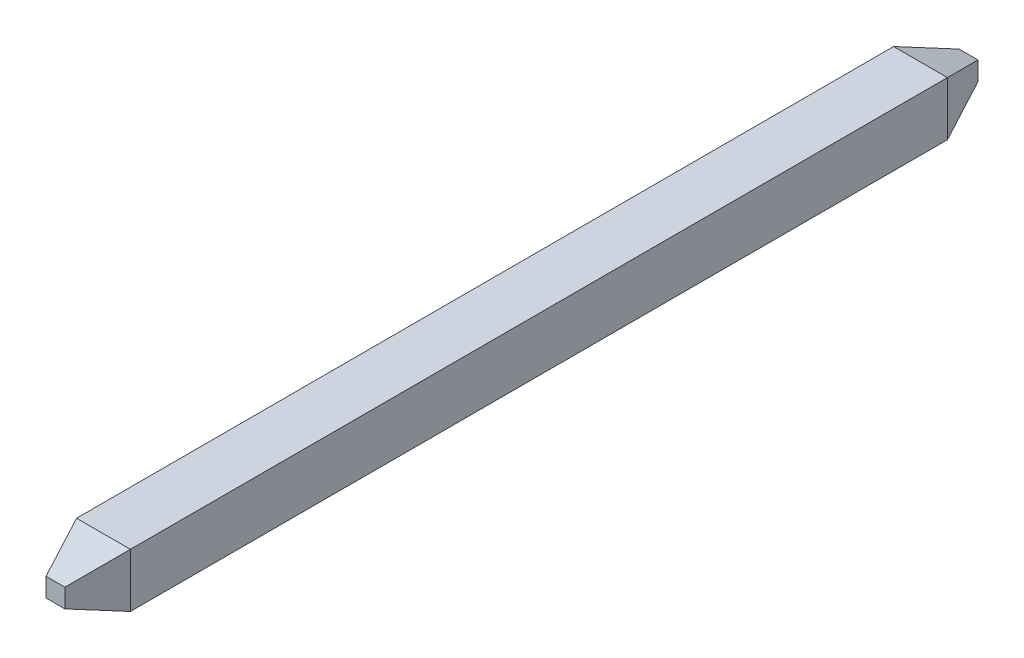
ISO-10303-21;
HEADER;
FILE_DESCRIPTION(('STEP AP214'),'2;1');
FILE_NAME('part.step','',(''),(''),'','','');
FILE_SCHEMA(('AUTOMOTIVE_DESIGN { 1 0 10303 214 1 1 1 1 }'));
ENDSEC;
DATA;
#1=APPLICATION_CONTEXT('core data for automotive mechanical design processes');
#2=APPLICATION_PROTOCOL_DEFINITION('international standard','automotive_design',2000,#1);
#3=PRODUCT_CONTEXT('',#1,'mechanical');
#4=PRODUCT('Part','Part','',(#3));
#5=PRODUCT_RELATED_PRODUCT_CATEGORY('part','',(#4));
#6=PRODUCT_DEFINITION_FORMATION('','',#4);
#7=PRODUCT_DEFINITION_CONTEXT('part definition',#1,'design');
#8=PRODUCT_DEFINITION('design','',#6,#7);
#9=PRODUCT_DEFINITION_SHAPE('','',#8);
#10=(LENGTH_UNIT() NAMED_UNIT(*) SI_UNIT(.MILLI.,.METRE.));
#11=(NAMED_UNIT(*) PLANE_ANGLE_UNIT() SI_UNIT($,.RADIAN.));
#12=(NAMED_UNIT(*) SI_UNIT($,.STERADIAN.) SOLID_ANGLE_UNIT());
#13=UNCERTAINTY_MEASURE_WITH_UNIT(LENGTH_MEASURE(1.E-05),#10,'distance_accuracy_value','');
#14=(GEOMETRIC_REPRESENTATION_CONTEXT(3) GLOBAL_UNCERTAINTY_ASSIGNED_CONTEXT((#13)) GLOBAL_UNIT_ASSIGNED_CONTEXT((#10,
#11,#12)) REPRESENTATION_CONTEXT('',''));
#15=CARTESIAN_POINT('',(0.,0.,0.));
#16=DIRECTION('',(0.,0.,1.));
#17=DIRECTION('',(1.,0.,0.));
#18=AXIS2_PLACEMENT_3D('',#15,#16,#17);
#19=CARTESIAN_POINT('',(-0.559999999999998,-0.560000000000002,17.));
#20=DIRECTION('',(0.,1.,0.));
#21=DIRECTION('',(-1.,0.,0.));
#22=AXIS2_PLACEMENT_3D('',#19,#20,#21);
#23=PLANE('',#22);
#24=DIRECTION('',(1.,0.,0.));
#25=VECTOR('',#24,1.);
#26=CARTESIAN_POINT('',(-0.559999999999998,-0.560000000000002,0.));
#27=LINE('',#26,#25);
#28=CARTESIAN_POINT('',(-0.559999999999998,-0.560000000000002,0.));
#29=VERTEX_POINT('',#28);
#30=CARTESIAN_POINT('',(0.559999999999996,-0.560000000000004,0.));
#31=VERTEX_POINT('',#30);
#32=EDGE_CURVE('E109',#29,#31,#27,.T.);
#33=ORIENTED_EDGE('',*,*,#32,.T.);
#34=DIRECTION('',(0.,0.,-1.));
#35=VECTOR('',#34,1.);
#36=CARTESIAN_POINT('',(0.560000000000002,-0.559999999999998,17.));
#37=LINE('',#36,#35);
#38=CARTESIAN_POINT('',(0.560000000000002,-0.559999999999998,17.));
#39=VERTEX_POINT('',#38);
#40=EDGE_CURVE('E11',#39,#31,#37,.T.);
#41=ORIENTED_EDGE('',*,*,#40,.F.);
#42=DIRECTION('',(1.,0.,0.));
#43=VECTOR('',#42,1.);
#44=CARTESIAN_POINT('',(-0.559999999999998,-0.560000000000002,17.));
#45=LINE('',#44,#43);
#46=CARTESIAN_POINT('',(-0.560000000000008,-0.560000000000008,17.));
#47=VERTEX_POINT('',#46);
#48=EDGE_CURVE('E124',#47,#39,#45,.T.);
#49=ORIENTED_EDGE('',*,*,#48,.F.);
#50=DIRECTION('',(0.,0.,-1.));
#51=VECTOR('',#50,1.);
#52=CARTESIAN_POINT('',(-0.559999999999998,-0.560000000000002,17.));
#53=LINE('',#52,#51);
#54=EDGE_CURVE('E122',#47,#29,#53,.T.);
#55=ORIENTED_EDGE('',*,*,#54,.T.);
#56=EDGE_LOOP('',(#33,#41,#49,#55));
#57=FACE_BOUND('',#56,.T.);
#58=ADVANCED_FACE('F33',(#57),#23,.F.);
#59=CARTESIAN_POINT('',(0.560000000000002,-0.559999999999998,17.));
#60=DIRECTION('',(-1.,0.,0.));
#61=DIRECTION('',(0.,-1.,0.));
#62=AXIS2_PLACEMENT_3D('',#59,#60,#61);
#63=PLANE('',#62);
#64=DIRECTION('',(0.,1.,0.));
#65=VECTOR('',#64,1.);
#66=CARTESIAN_POINT('',(0.560000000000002,-0.559999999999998,0.));
#67=LINE('',#66,#65);
#68=CARTESIAN_POINT('',(0.559999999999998,0.560000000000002,0.));
#69=VERTEX_POINT('',#68);
#70=EDGE_CURVE('E116',#31,#69,#67,.T.);
#71=ORIENTED_EDGE('',*,*,#70,.T.);
#72=DIRECTION('',(0.,0.,-1.));
#73=VECTOR('',#72,1.);
#74=CARTESIAN_POINT('',(0.559999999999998,0.560000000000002,17.));
#75=LINE('',#74,#73);
#76=CARTESIAN_POINT('',(0.559999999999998,0.560000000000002,17.));
#77=VERTEX_POINT('',#76);
#78=EDGE_CURVE('E41',#77,#69,#75,.T.);
#79=ORIENTED_EDGE('',*,*,#78,.F.);
#80=DIRECTION('',(0.,1.,0.));
#81=VECTOR('',#80,1.);
#82=CARTESIAN_POINT('',(0.560000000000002,-0.559999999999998,17.));
#83=LINE('',#82,#81);
#84=EDGE_CURVE('E144',#39,#77,#83,.T.);
#85=ORIENTED_EDGE('',*,*,#84,.F.);
#86=ORIENTED_EDGE('',*,*,#40,.T.);
#87=EDGE_LOOP('',(#71,#79,#85,#86));
#88=FACE_BOUND('',#87,.T.);
#89=ADVANCED_FACE('F142',(#88),#63,.F.);
#90=CARTESIAN_POINT('',(0.559999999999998,0.560000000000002,17.));
#91=DIRECTION('',(0.,-1.,0.));
#92=DIRECTION('',(1.,0.,0.));
#93=AXIS2_PLACEMENT_3D('',#90,#91,#92);
#94=PLANE('',#93);
#95=DIRECTION('',(-1.,0.,0.));
#96=VECTOR('',#95,1.);
#97=CARTESIAN_POINT('',(0.559999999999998,0.560000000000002,0.));
#98=LINE('',#97,#96);
#99=CARTESIAN_POINT('',(-0.56,0.56,0.));
#100=VERTEX_POINT('',#99);
#101=EDGE_CURVE('E125',#69,#100,#98,.T.);
#102=ORIENTED_EDGE('',*,*,#101,.T.);
#103=DIRECTION('',(0.,0.,-1.));
#104=VECTOR('',#103,1.);
#105=CARTESIAN_POINT('',(-0.560000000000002,0.559999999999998,17.));
#106=LINE('',#105,#104);
#107=CARTESIAN_POINT('',(-0.560000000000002,0.559999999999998,17.));
#108=VERTEX_POINT('',#107);
#109=EDGE_CURVE('E48',#108,#100,#106,.T.);
#110=ORIENTED_EDGE('',*,*,#109,.F.);
#111=DIRECTION('',(-1.,0.,0.));
#112=VECTOR('',#111,1.);
#113=CARTESIAN_POINT('',(0.559999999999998,0.560000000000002,17.));
#114=LINE('',#113,#112);
#115=EDGE_CURVE('E131',#77,#108,#114,.T.);
#116=ORIENTED_EDGE('',*,*,#115,.F.);
#117=ORIENTED_EDGE('',*,*,#78,.T.);
#118=EDGE_LOOP('',(#102,#110,#116,#117));
#119=FACE_BOUND('',#118,.T.);
#120=ADVANCED_FACE('F135',(#119),#94,.F.);
#121=CARTESIAN_POINT('',(-0.560000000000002,0.559999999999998,17.));
#122=DIRECTION('',(1.,0.,0.));
#123=DIRECTION('',(0.,1.,0.));
#124=AXIS2_PLACEMENT_3D('',#121,#122,#123);
#125=PLANE('',#124);
#126=DIRECTION('',(0.,-1.,0.));
#127=VECTOR('',#126,1.);
#128=CARTESIAN_POINT('',(-0.560000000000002,0.559999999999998,0.));
#129=LINE('',#128,#127);
#130=EDGE_CURVE('E98',#100,#29,#129,.T.);
#131=ORIENTED_EDGE('',*,*,#130,.T.);
#132=ORIENTED_EDGE('',*,*,#54,.F.);
#133=DIRECTION('',(0.,-1.,0.));
#134=VECTOR('',#133,1.);
#135=CARTESIAN_POINT('',(-0.560000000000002,0.559999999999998,17.));
#136=LINE('',#135,#134);
#137=EDGE_CURVE('E128',#108,#47,#136,.T.);
#138=ORIENTED_EDGE('',*,*,#137,.F.);
#139=ORIENTED_EDGE('',*,*,#109,.T.);
#140=EDGE_LOOP('',(#131,#132,#138,#139));
#141=FACE_BOUND('',#140,.T.);
#142=ADVANCED_FACE('F121',(#141),#125,.F.);
#143=CARTESIAN_POINT('',(0.560000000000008,-0.560000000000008,17.));
#144=DIRECTION('',(0.939692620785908,0.,0.342020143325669));
#145=DIRECTION('',(0.342020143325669,0.,-0.939692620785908));
#146=AXIS2_PLACEMENT_3D('',#143,#144,#145);
#147=PLANE('',#146);
#148=ORIENTED_EDGE('',*,*,#84,.T.);
#149=DIRECTION('',(0.323615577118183,0.323615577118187,-0.889126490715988));
#150=VECTOR('',#149,1.);
#151=CARTESIAN_POINT('',(0.559999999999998,0.560000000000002,17.));
#152=LINE('',#151,#150);
#153=CARTESIAN_POINT('',(0.196029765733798,0.196029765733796,18.));
#154=VERTEX_POINT('',#153);
#155=EDGE_CURVE('E117',#154,#77,#152,.T.);
#156=ORIENTED_EDGE('',*,*,#155,.F.);
#157=DIRECTION('',(0.,-1.,0.));
#158=VECTOR('',#157,1.);
#159=CARTESIAN_POINT('',(0.196029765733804,-0.560000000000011,18.));
#160=LINE('',#159,#158);
#161=CARTESIAN_POINT('',(0.196029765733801,-0.196029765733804,18.));
#162=VERTEX_POINT('',#161);
#163=EDGE_CURVE('E104',#162,#154,#160,.F.);
#164=ORIENTED_EDGE('',*,*,#163,.F.);
#165=DIRECTION('',(0.323615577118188,-0.323615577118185,-0.889126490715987));
#166=VECTOR('',#165,1.);
#167=CARTESIAN_POINT('',(0.560000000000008,-0.560000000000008,17.));
#168=LINE('',#167,#166);
#169=EDGE_CURVE('E153',#162,#39,#168,.T.);
#170=ORIENTED_EDGE('',*,*,#169,.T.);
#171=EDGE_LOOP('',(#148,#156,#164,#170));
#172=FACE_BOUND('',#171,.T.);
#173=ADVANCED_FACE('F205',(#172),#147,.T.);
#174=CARTESIAN_POINT('',(0.559999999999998,0.560000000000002,17.));
#175=DIRECTION('',(0.,0.939692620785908,0.342020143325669));
#176=DIRECTION('',(0.,-0.342020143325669,0.939692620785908));
#177=AXIS2_PLACEMENT_3D('',#174,#175,#176);
#178=PLANE('',#177);
#179=ORIENTED_EDGE('',*,*,#115,.T.);
#180=DIRECTION('',(-0.323615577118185,0.323615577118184,-0.889126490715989));
#181=VECTOR('',#180,1.);
#182=CARTESIAN_POINT('',(-0.560000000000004,0.559999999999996,17.));
#183=LINE('',#182,#181);
#184=CARTESIAN_POINT('',(-0.196029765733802,0.196029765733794,18.));
#185=VERTEX_POINT('',#184);
#186=EDGE_CURVE('E160',#185,#108,#183,.T.);
#187=ORIENTED_EDGE('',*,*,#186,.F.);
#188=DIRECTION('',(1.,0.,0.));
#189=VECTOR('',#188,1.);
#190=CARTESIAN_POINT('',(0.56,0.196029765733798,18.));
#191=LINE('',#190,#189);
#192=EDGE_CURVE('E156',#154,#185,#191,.F.);
#193=ORIENTED_EDGE('',*,*,#192,.F.);
#194=ORIENTED_EDGE('',*,*,#155,.T.);
#195=EDGE_LOOP('',(#179,#187,#193,#194));
#196=FACE_BOUND('',#195,.T.);
#197=ADVANCED_FACE('F206',(#196),#178,.T.);
#198=CARTESIAN_POINT('',(-0.560000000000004,0.559999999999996,17.));
#199=DIRECTION('',(-0.939692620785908,0.,0.342020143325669));
#200=DIRECTION('',(0.342020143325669,0.,0.939692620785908));
#201=AXIS2_PLACEMENT_3D('',#198,#199,#200);
#202=PLANE('',#201);
#203=ORIENTED_EDGE('',*,*,#137,.T.);
#204=DIRECTION('',(-0.323615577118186,-0.323615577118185,-0.889126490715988));
#205=VECTOR('',#204,1.);
#206=CARTESIAN_POINT('',(-0.560000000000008,-0.560000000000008,17.));
#207=LINE('',#206,#205);
#208=CARTESIAN_POINT('',(-0.196029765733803,-0.196029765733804,18.));
#209=VERTEX_POINT('',#208);
#210=EDGE_CURVE('E163',#209,#47,#207,.T.);
#211=ORIENTED_EDGE('',*,*,#210,.F.);
#212=DIRECTION('',(0.,1.,0.));
#213=VECTOR('',#212,1.);
#214=CARTESIAN_POINT('',(-0.1960297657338,0.559999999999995,18.));
#215=LINE('',#214,#213);
#216=EDGE_CURVE('E154',#185,#209,#215,.F.);
#217=ORIENTED_EDGE('',*,*,#216,.F.);
#218=ORIENTED_EDGE('',*,*,#186,.T.);
#219=EDGE_LOOP('',(#203,#211,#217,#218));
#220=FACE_BOUND('',#219,.T.);
#221=ADVANCED_FACE('F209',(#220),#202,.T.);
#222=CARTESIAN_POINT('',(-0.560000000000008,-0.560000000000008,17.));
#223=DIRECTION('',(0.,-0.939692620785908,0.342020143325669));
#224=DIRECTION('',(0.,-0.342020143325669,-0.939692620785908));
#225=AXIS2_PLACEMENT_3D('',#222,#223,#224);
#226=PLANE('',#225);
#227=ORIENTED_EDGE('',*,*,#48,.T.);
#228=ORIENTED_EDGE('',*,*,#169,.F.);
#229=DIRECTION('',(-1.,0.,0.));
#230=VECTOR('',#229,1.);
#231=CARTESIAN_POINT('',(-0.560000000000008,-0.196029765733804,18.));
#232=LINE('',#231,#230);
#233=EDGE_CURVE('E151',#209,#162,#232,.F.);
#234=ORIENTED_EDGE('',*,*,#233,.F.);
#235=ORIENTED_EDGE('',*,*,#210,.T.);
#236=EDGE_LOOP('',(#227,#228,#234,#235));
#237=FACE_BOUND('',#236,.T.);
#238=ADVANCED_FACE('F213',(#237),#226,.T.);
#239=CARTESIAN_POINT('',(0.559999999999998,0.560000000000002,18.));
#240=DIRECTION('',(0.,0.,1.));
#241=DIRECTION('',(1.,0.,0.));
#242=AXIS2_PLACEMENT_3D('',#239,#240,#241);
#243=PLANE('',#242);
#244=ORIENTED_EDGE('',*,*,#163,.T.);
#245=ORIENTED_EDGE('',*,*,#192,.T.);
#246=ORIENTED_EDGE('',*,*,#216,.T.);
#247=ORIENTED_EDGE('',*,*,#233,.T.);
#248=EDGE_LOOP('',(#244,#245,#246,#247));
#249=FACE_BOUND('',#248,.T.);
#250=ADVANCED_FACE('F217',(#249),#243,.T.);
#251=CARTESIAN_POINT('',(0.559999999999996,-0.560000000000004,0.));
#252=DIRECTION('',(0.,-0.939692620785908,-0.342020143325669));
#253=DIRECTION('',(0.,0.342020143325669,-0.939692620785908));
#254=AXIS2_PLACEMENT_3D('',#251,#252,#253);
#255=PLANE('',#254);
#256=ORIENTED_EDGE('',*,*,#32,.F.);
#257=DIRECTION('',(-0.323615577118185,-0.323615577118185,0.889126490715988));
#258=VECTOR('',#257,1.);
#259=CARTESIAN_POINT('',(-0.559999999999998,-0.560000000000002,0.));
#260=LINE('',#259,#258);
#261=CARTESIAN_POINT('',(-0.196029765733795,-0.196029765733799,-1.));
#262=VERTEX_POINT('',#261);
#263=EDGE_CURVE('E93',#262,#29,#260,.T.);
#264=ORIENTED_EDGE('',*,*,#263,.F.);
#265=DIRECTION('',(1.,0.,0.));
#266=VECTOR('',#265,1.);
#267=CARTESIAN_POINT('',(0.559999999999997,-0.196029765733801,-1.));
#268=LINE('',#267,#266);
#269=CARTESIAN_POINT('',(0.196029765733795,-0.1960297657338,-1.));
#270=VERTEX_POINT('',#269);
#271=EDGE_CURVE('E174',#270,#262,#268,.F.);
#272=ORIENTED_EDGE('',*,*,#271,.F.);
#273=DIRECTION('',(0.323615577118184,-0.323615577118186,0.889126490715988));
#274=VECTOR('',#273,1.);
#275=CARTESIAN_POINT('',(0.559999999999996,-0.560000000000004,0.));
#276=LINE('',#275,#274);
#277=EDGE_CURVE('E112',#270,#31,#276,.T.);
#278=ORIENTED_EDGE('',*,*,#277,.T.);
#279=EDGE_LOOP('',(#256,#264,#272,#278));
#280=FACE_BOUND('',#279,.T.);
#281=ADVANCED_FACE('F110',(#280),#255,.T.);
#282=CARTESIAN_POINT('',(-0.559999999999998,-0.560000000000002,0.));
#283=DIRECTION('',(-0.939692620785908,0.,-0.342020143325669));
#284=DIRECTION('',(-0.342020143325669,0.,0.939692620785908));
#285=AXIS2_PLACEMENT_3D('',#282,#283,#284);
#286=PLANE('',#285);
#287=ORIENTED_EDGE('',*,*,#130,.F.);
#288=DIRECTION('',(-0.323615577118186,0.323615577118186,0.889126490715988));
#289=VECTOR('',#288,1.);
#290=CARTESIAN_POINT('',(-0.56,0.56,0.));
#291=LINE('',#290,#289);
#292=CARTESIAN_POINT('',(-0.196029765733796,0.196029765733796,-1.));
#293=VERTEX_POINT('',#292);
#294=EDGE_CURVE('E105',#293,#100,#291,.T.);
#295=ORIENTED_EDGE('',*,*,#294,.F.);
#296=DIRECTION('',(0.,-1.,0.));
#297=VECTOR('',#296,1.);
#298=CARTESIAN_POINT('',(-0.196029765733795,-0.560000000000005,-1.));
#299=LINE('',#298,#297);
#300=EDGE_CURVE('E100',#262,#293,#299,.F.);
#301=ORIENTED_EDGE('',*,*,#300,.F.);
#302=ORIENTED_EDGE('',*,*,#263,.T.);
#303=EDGE_LOOP('',(#287,#295,#301,#302));
#304=FACE_BOUND('',#303,.T.);
#305=ADVANCED_FACE('F95',(#304),#286,.T.);
#306=CARTESIAN_POINT('',(-0.56,0.56,0.));
#307=DIRECTION('',(0.,0.939692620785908,-0.342020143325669));
#308=DIRECTION('',(0.,0.342020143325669,0.939692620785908));
#309=AXIS2_PLACEMENT_3D('',#306,#307,#308);
#310=PLANE('',#309);
#311=ORIENTED_EDGE('',*,*,#101,.F.);
#312=DIRECTION('',(0.323615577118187,0.323615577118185,0.889126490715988));
#313=VECTOR('',#312,1.);
#314=CARTESIAN_POINT('',(0.560000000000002,0.559999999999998,0.));
#315=LINE('',#314,#313);
#316=CARTESIAN_POINT('',(0.196029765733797,0.196029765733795,-1.));
#317=VERTEX_POINT('',#316);
#318=EDGE_CURVE('E177',#317,#69,#315,.T.);
#319=ORIENTED_EDGE('',*,*,#318,.F.);
#320=DIRECTION('',(-1.,0.,0.));
#321=VECTOR('',#320,1.);
#322=CARTESIAN_POINT('',(0.559999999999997,0.196029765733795,-1.));
#323=LINE('',#322,#321);
#324=EDGE_CURVE('E171',#293,#317,#323,.F.);
#325=ORIENTED_EDGE('',*,*,#324,.F.);
#326=ORIENTED_EDGE('',*,*,#294,.T.);
#327=EDGE_LOOP('',(#311,#319,#325,#326));
#328=FACE_BOUND('',#327,.T.);
#329=ADVANCED_FACE('F184',(#328),#310,.T.);
#330=CARTESIAN_POINT('',(0.560000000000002,0.559999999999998,0.));
#331=DIRECTION('',(0.939692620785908,0.,-0.342020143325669));
#332=DIRECTION('',(-0.342020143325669,0.,-0.939692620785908));
#333=AXIS2_PLACEMENT_3D('',#330,#331,#332);
#334=PLANE('',#333);
#335=ORIENTED_EDGE('',*,*,#70,.F.);
#336=ORIENTED_EDGE('',*,*,#277,.F.);
#337=DIRECTION('',(0.,1.,0.));
#338=VECTOR('',#337,1.);
#339=CARTESIAN_POINT('',(0.196029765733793,-0.560000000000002,-1.));
#340=LINE('',#339,#338);
#341=EDGE_CURVE('E169',#317,#270,#340,.F.);
#342=ORIENTED_EDGE('',*,*,#341,.F.);
#343=ORIENTED_EDGE('',*,*,#318,.T.);
#344=EDGE_LOOP('',(#335,#336,#342,#343));
#345=FACE_BOUND('',#344,.T.);
#346=ADVANCED_FACE('F181',(#345),#334,.T.);
#347=CARTESIAN_POINT('',(0.559999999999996,-0.560000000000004,-1.));
#348=DIRECTION('',(0.,0.,1.));
#349=DIRECTION('',(1.,0.,0.));
#350=AXIS2_PLACEMENT_3D('',#347,#348,#349);
#351=PLANE('',#350);
#352=ORIENTED_EDGE('',*,*,#271,.T.);
#353=ORIENTED_EDGE('',*,*,#300,.T.);
#354=ORIENTED_EDGE('',*,*,#324,.T.);
#355=ORIENTED_EDGE('',*,*,#341,.T.);
#356=EDGE_LOOP('',(#352,#353,#354,#355));
#357=FACE_BOUND('',#356,.T.);
#358=ADVANCED_FACE('F186',(#357),#351,.F.);
#359=CLOSED_SHELL('',(#58,#89,#120,#142,#173,#197,#221,#238,#250,#281,#305,#329,#346,#358));
#360=MANIFOLD_SOLID_BREP('B2',#359);
#361=ADVANCED_BREP_SHAPE_REPRESENTATION('',(#18,#360),#14);
#362=SHAPE_DEFINITION_REPRESENTATION(#9,#361);
ENDSEC;
END-ISO-10303-21;
